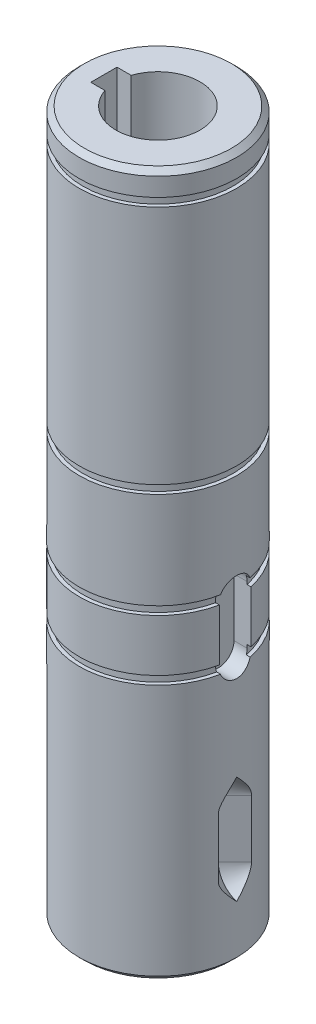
from build123d import *

# Parameters (mm, degrees)
ENL_V_MAT_EXTRU_2_REACH = 137.669
ESQUISSE2_W             = 6.064758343
ESQUISSE2_H             = 5
ENL_V_MAT_EXTRU_4_DEPTH = 10
CHANFREIN1_SIZE         = 1
ESQUISSE7_R             = 11
ENL_V_MAT_EXTRU_5_DEPTH = 105
ENL_V_MAT_EXTRU_6_DEPTH = 11


with BuildPart() as part:
    # Esquisse1 → Base-R_volution (revolve)
    with BuildSketch(Plane.XY, mode=Mode.PRIVATE) as base_r_volution_sk:
        Polygon((8, 0), (8, -134), (15, -134), (15, -84.98), (14.3, -84.98), (14.3, -83.38), (15, -83.38), (15, -73.48), (14.3, -73.48), (14.3, -71.88), (15, -71.88), (15, -53.5), (14.3, -53.5), (14.3, -51.9), (15, -51.9), (15, -6.1), (14.3, -6.1), (14.3, -4.5), (15, -4.5), (15, 0), align=None)
    revolve(base_r_volution_sk.sketch.rotate(Axis((0, 0, 0), (0, -1, 0)), 90), axis=Axis((0, 0, 0), (0, -1, 0)))

    # Esquisse2 → Enl_v. mat.-Extru.2 (cut, up to next)
    with BuildSketch(Plane(origin=(0, 0, 0), x_dir=(-1, 0, 0), z_dir=(0, 1, 0)), mode=Mode.PRIVATE) as enl_v_mat_extru_2_sk1:
        with Locations((7.267620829, 0)):
            Rectangle(ESQUISSE2_W, ESQUISSE2_H)
    enl_v_mat_extru_2_tool1 = extrude(enl_v_mat_extru_2_sk1.sketch, amount=-ENL_V_MAT_EXTRU_2_REACH, mode=Mode.PRIVATE) & part.part
    add(enl_v_mat_extru_2_tool1.solids().sort_by_distance((-7.267621, 0, 0))[0], mode=Mode.SUBTRACT)

    # Esquisse6 → Enl_v. mat.-Extru.4 (cut)
    with BuildSketch(Plane(origin=(11.5, 0, 0), x_dir=(0, 0, -1), z_dir=(1, 0, 0))):
        with BuildLine():
            Line((3, -72.98), (3, -83.98))
            ThreePointArc((3, -83.98), (0, -86.98), (-3, -83.98))
            Line((-3, -83.98), (-3, -72.98))
            ThreePointArc((-3, -72.98), (0, -69.98), (3, -72.98))
        make_face()
    extrude(amount=ENL_V_MAT_EXTRU_4_DEPTH, mode=Mode.SUBTRACT)

    # Chanfrein1
    chanfrein1_edges = [part.edges().sort_by_distance(p)[0] for p in [
        (0, 0, -15),
        (0, -134, -15),
    ]]
    chamfer(chanfrein1_edges, length=CHANFREIN1_SIZE)

    # Esquisse7 → Enl_v. mat.-Extru.5 (cut)
    with BuildSketch(Plane.XZ.offset(134)):
        with Locations(Location((0, 0, 0), (0, 0, 270))):
            Circle(ESQUISSE7_R)
    extrude(amount=-ENL_V_MAT_EXTRU_5_DEPTH, mode=Mode.SUBTRACT)

    # Esquisse8 → Enl_v. mat.-Extru.6 (cut)
    with BuildSketch(Plane.XZ.offset(119)):
        Polygon((11.5, 0), (21.5, 10), (21.5, -10), align=None)
    extrude(amount=-ENL_V_MAT_EXTRU_6_DEPTH, mode=Mode.SUBTRACT)

    # Esquisse9 → Enl_vement de mati_re-R_volution2 (revolve, cut)
    with BuildSketch(Plane.XZ.offset(108)):
        Polygon((11.5, 0), (16.5, -5), (16.5, 5), align=None)
    revolve(axis=Axis((16.5, -108, 11.119598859), (0, 0, -1)), mode=Mode.SUBTRACT)

    # Esquisse10 → Enl_vement de mati_re-R_volution3 (revolve, cut)
    with BuildSketch(Plane(origin=(0, -119, 0), x_dir=(-1, 0, 0), z_dir=(0, 1, 0))):
        Polygon((-16.5, -5), (-11.5, 0), (-16.5, 5), align=None)
    revolve(axis=Axis((16.5, -119, 11.119598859), (0, 0, -1)), mode=Mode.SUBTRACT)


solid = part.part
